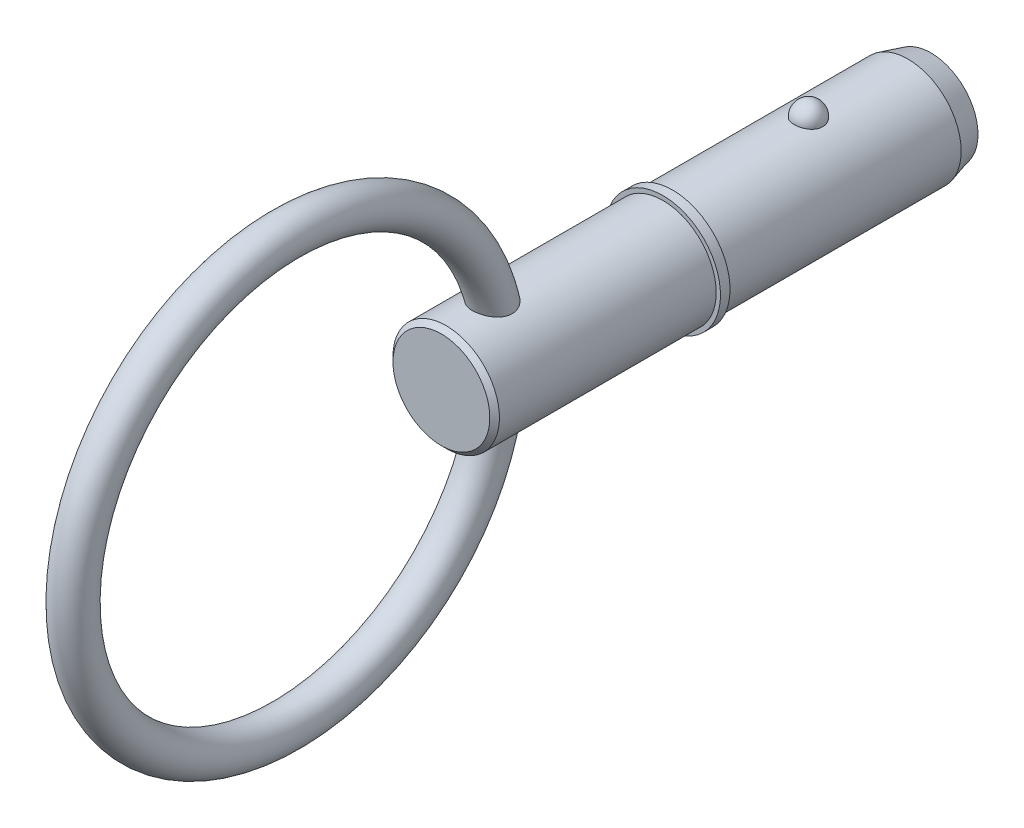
from build123d import *

# Parameters (mm, degrees)
SKETCH2_R           = 5.555
BOSS_EXTRUDE1_DEPTH = 12.7
BOSS_EXTRUDE2_START = 14.27
SKETCH3_R           = 5.555
BOSS_EXTRUDE2_DEPTH = 14.27
CHAMFER1_SIZE       = 2.4
CHAMFER1_SIZE2      = 0.643078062
SKETCH20_W          = 1
SKETCH20_H          = 6
SKETCH21_R          = 5.555
BOSS_EXTRUDE3_DEPTH = 24.13
CHAMFER2_SIZE       = 0.5
SKETCH24_R          = 2


with BuildPart() as part:
    # Sketch2 → Boss-Extrude1 (new body)
    with BuildSketch(Plane.XY):
        Circle(SKETCH2_R)
    extrude(amount=BOSS_EXTRUDE1_DEPTH)

    # Sketch3 → Boss-Extrude2 (add)
    with BuildSketch(Plane(origin=(0, 0, 0), x_dir=(-1, 0, 0), z_dir=(0, 0, -1)).offset(BOSS_EXTRUDE2_START)):
        Circle(SKETCH3_R)
    extrude(amount=-BOSS_EXTRUDE2_DEPTH)

    # Chamfer1
    chamfer1_edges = [part.edges().sort_by_distance(p)[0] for p in [
        (5.555, 0, -14.27),
    ]]
    chamfer1_side = [part.faces().sort_by_distance(p)[0] for p in [
        (5.555, 0, -7.135),
    ]]
    chamfer(chamfer1_edges, length=CHAMFER1_SIZE, length2=CHAMFER1_SIZE2, reference=chamfer1_side[0])

    # Sketch18 → Revolve1 (revolve)
    with BuildSketch(Plane(origin=(0, 0, 0), x_dir=(0, 0, -1), z_dir=(1, 0, 0))):
        with BuildLine():
            Line((1.49, 7.045), (1.49, 4.065))
            ThreePointArc((1.49, 4.065), (0, 5.555), (1.49, 7.045))
        make_face()
    revolve(axis=Axis((0, 7.045, -1.49), (0, -1, 0)))

    # Sketch20 → Revolve2 (revolve)
    with BuildSketch(Plane(origin=(0, 0, 0), x_dir=(0, 0, -1), z_dir=(1, 0, 0)), mode=Mode.PRIVATE) as revolve2_sk:
        with Locations((-13.2, 3)):
            Rectangle(SKETCH20_W, SKETCH20_H)
    revolve(revolve2_sk.sketch.rotate(Axis((0, 0, 33.728787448), (0, 0, 1)), 270), axis=Axis((0, 0, 33.728787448), (0, 0, 1)))

    # Sketch21 → Boss-Extrude3 (add)
    with BuildSketch(Plane(origin=(0, 0, 12.7), x_dir=(-1, 0, 0), z_dir=(0, 0, -1))):
        with Locations(Location((0, 0, 0), (0, 0, 180))):
            Circle(SKETCH21_R)
    extrude(amount=-BOSS_EXTRUDE3_DEPTH)

    # Chamfer2
    chamfer2_edges = [part.edges().sort_by_distance(p)[0] for p in [
        (-5.555, 0, 36.83),
    ]]
    chamfer(chamfer2_edges, length=CHAMFER2_SIZE)

    # Sweep1: sweep along a path in Sketch23
    with BuildLine(Plane(origin=(0, 0, 0), x_dir=(0, 0, -1), z_dir=(1, 0, 0))) as sweep1_path:
        CenterArc((-53.055, 0), 22.225, 0, 360)
    # Sketch24 → Sweep1 (sweep)
    with BuildSketch(Plane(origin=(0, 0, 0), x_dir=(1, 0, 0), z_dir=(0, 1, 0))):
        with Locations((0, -30.83)):
            Circle(SKETCH24_R)
    sweep(path=sweep1_path.line)


solid = part.part
